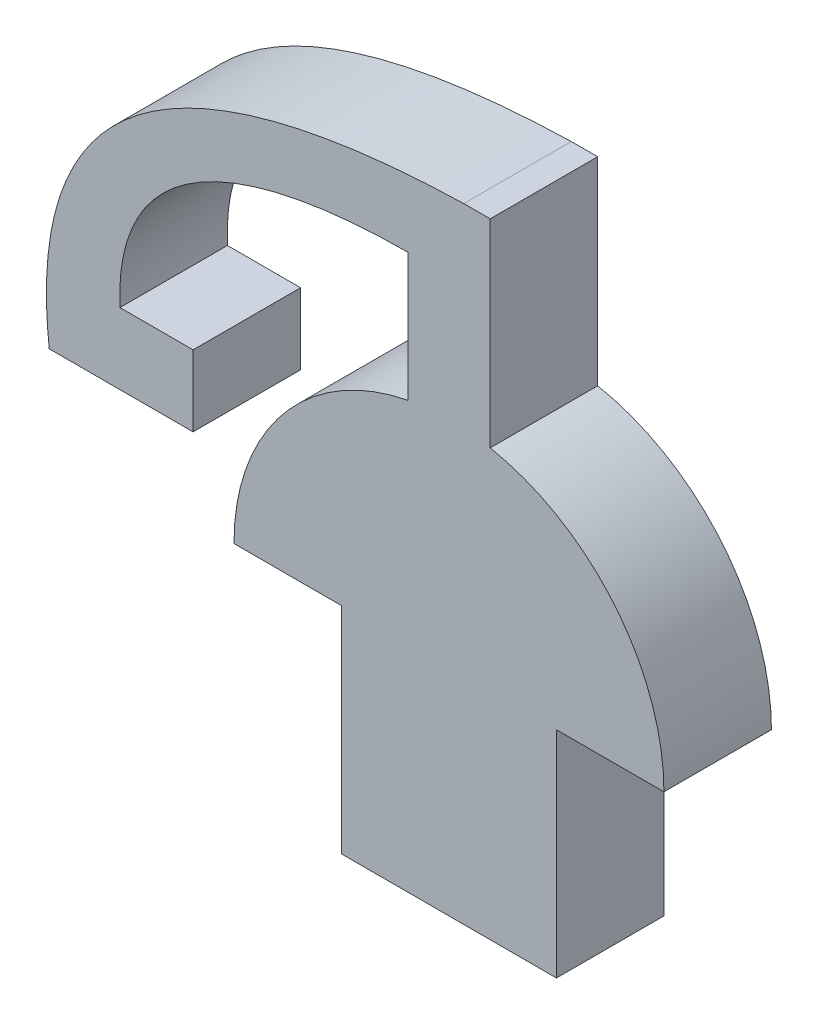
from build123d import *

# Parameters (mm, degrees)
BOSS_EXTRUDE1_DEPTH = 3.175


with BuildPart() as part:
    # Sketch1 → Boss-Extrude1 (new body)
    with BuildSketch(Plane.XY):
        with BuildLine():
            Line((-11.805369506, 2.25252211), (-7.55702563, 2.25252211))
            Line((-7.55702563, 2.25252211), (-7.55702563, 4.352383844))
            Line((-7.55702563, 4.352383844), (-9.71832556, 4.352383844))
            add(Edge.make_bspline(
                [(-9.71832556, 4.352383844), (-9.927448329, 9.23191514), (-4.660548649, 10.007359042), (-1.212544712, 10.02048332)],
                knots=[0, 0, 0, 0, 0.593316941, 0.593316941, 0.593316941, 0.593316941], degree=3))
            Line((-1.212544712, 10.02048332), (-1.212544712, 6.233156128))
            ThreePointArc((-1.212544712, 6.233156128), (-4.900110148, 4.038739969), (-6.35, 0))
            Line((-6.35, 0), (-3.175, 0))
            Line((-3.175, 0), (-3.175, -6.35))
            Line((-3.175, -6.35), (0, -6.35))
            Line((0, -6.35), (3.175, -6.35))
            Line((3.175, -6.35), (3.175, 0))
            Line((3.175, 0), (6.35, 0))
            ThreePointArc((6.35, 0), (4.901907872, 4.036557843), (1.218094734, 6.23207391))
            Line((1.218094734, 6.23207391), (1.218094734, 12.090521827))
            Line((1.218094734, 12.090521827), (0.437924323, 12.090521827))
            add(Edge.make_bspline(
                [(0.437924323, 12.090521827), (-12.909800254, 11.738680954), (-11.805369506, 2.25252211)],
                knots=[0, 0, 0, 1, 1, 1], degree=2))
        make_face()
    extrude(amount=BOSS_EXTRUDE1_DEPTH)


solid = part.part
